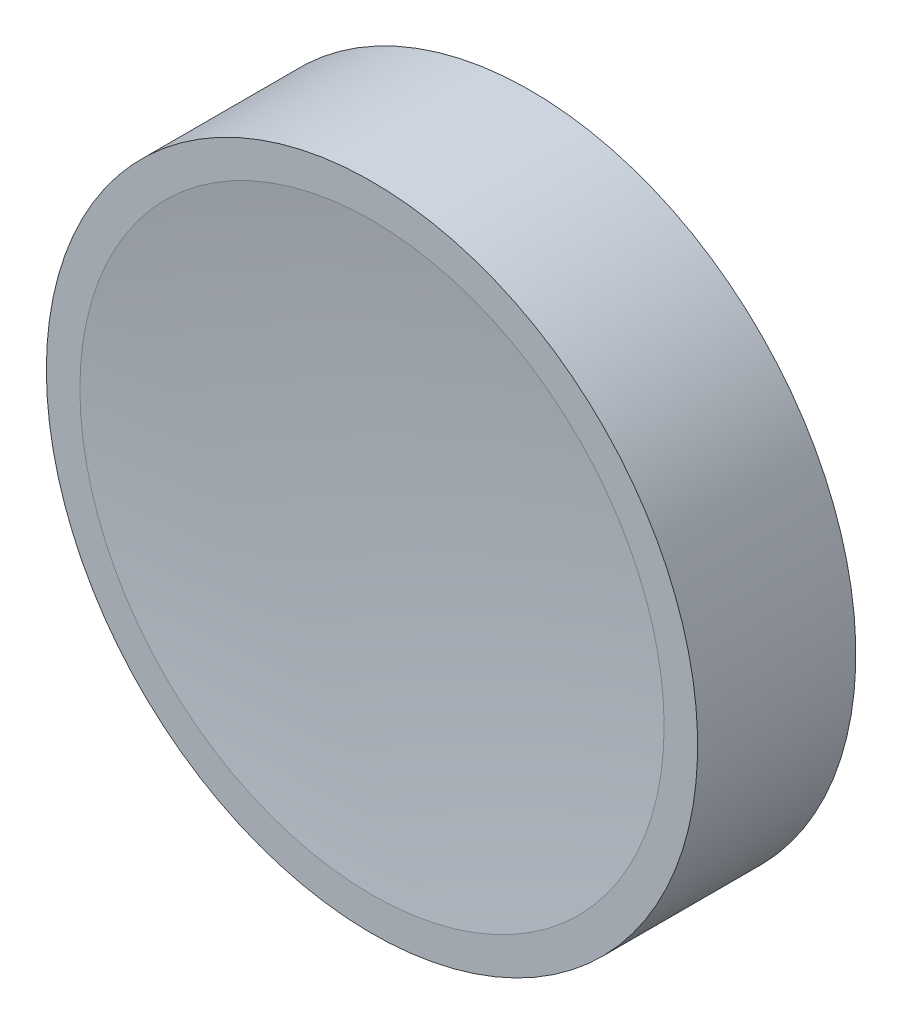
ISO-10303-21;
HEADER;
FILE_DESCRIPTION(('STEP AP214'),'2;1');
FILE_NAME('part.step','',(''),(''),'','','');
FILE_SCHEMA(('AUTOMOTIVE_DESIGN { 1 0 10303 214 1 1 1 1 }'));
ENDSEC;
DATA;
#1=APPLICATION_CONTEXT('core data for automotive mechanical design processes');
#2=APPLICATION_PROTOCOL_DEFINITION('international standard','automotive_design',2000,#1);
#3=PRODUCT_CONTEXT('',#1,'mechanical');
#4=PRODUCT('Part','Part','',(#3));
#5=PRODUCT_RELATED_PRODUCT_CATEGORY('part','',(#4));
#6=PRODUCT_DEFINITION_FORMATION('','',#4);
#7=PRODUCT_DEFINITION_CONTEXT('part definition',#1,'design');
#8=PRODUCT_DEFINITION('design','',#6,#7);
#9=PRODUCT_DEFINITION_SHAPE('','',#8);
#10=(LENGTH_UNIT() NAMED_UNIT(*) SI_UNIT(.MILLI.,.METRE.));
#11=(NAMED_UNIT(*) PLANE_ANGLE_UNIT() SI_UNIT($,.RADIAN.));
#12=(NAMED_UNIT(*) SI_UNIT($,.STERADIAN.) SOLID_ANGLE_UNIT());
#13=UNCERTAINTY_MEASURE_WITH_UNIT(LENGTH_MEASURE(1.E-05),#10,'distance_accuracy_value','');
#14=(GEOMETRIC_REPRESENTATION_CONTEXT(3) GLOBAL_UNCERTAINTY_ASSIGNED_CONTEXT((#13)) GLOBAL_UNIT_ASSIGNED_CONTEXT((#10,
#11,#12)) REPRESENTATION_CONTEXT('',''));
#15=CARTESIAN_POINT('',(0.,0.,0.));
#16=DIRECTION('',(0.,0.,1.));
#17=DIRECTION('',(1.,0.,0.));
#18=AXIS2_PLACEMENT_3D('',#15,#16,#17);
#19=CARTESIAN_POINT('',(0.,0.,9.6572));
#20=DIRECTION('',(0.,0.,-1.));
#21=DIRECTION('',(-1.,0.,0.));
#22=AXIS2_PLACEMENT_3D('',#19,#20,#21);
#23=CYLINDRICAL_SURFACE('',#22,17.);
#24=CARTESIAN_POINT('',(0.,0.,9.4295346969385));
#25=DIRECTION('',(0.,0.,-1.));
#26=DIRECTION('',(-1.,0.,0.));
#27=AXIS2_PLACEMENT_3D('',#24,#25,#26);
#28=CIRCLE('',#27,16.9999999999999);
#29=CARTESIAN_POINT('',(-16.9999999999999,0.,9.4295346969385));
#30=VERTEX_POINT('',#29);
#31=EDGE_CURVE('E43',#30,#30,#28,.T.);
#32=ORIENTED_EDGE('',*,*,#31,.T.);
#33=EDGE_LOOP('',(#32));
#34=FACE_BOUND('',#33,.T.);
#35=CARTESIAN_POINT('',(0.,0.,1.17120102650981));
#36=DIRECTION('',(0.,0.,-1.));
#37=DIRECTION('',(-1.,0.,0.));
#38=AXIS2_PLACEMENT_3D('',#35,#36,#37);
#39=CIRCLE('',#38,17.);
#40=CARTESIAN_POINT('',(-17.,0.,1.17120102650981));
#41=VERTEX_POINT('',#40);
#42=EDGE_CURVE('E10',#41,#41,#39,.T.);
#43=ORIENTED_EDGE('',*,*,#42,.F.);
#44=EDGE_LOOP('',(#43));
#45=FACE_BOUND('',#44,.T.);
#46=ADVANCED_FACE('F33',(#34,#45),#23,.T.);
#47=CARTESIAN_POINT('',(-17.,0.,1.17120102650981));
#48=DIRECTION('',(0.,0.,1.));
#49=DIRECTION('',(1.,0.,0.));
#50=AXIS2_PLACEMENT_3D('',#47,#48,#49);
#51=PLANE('',#50);
#52=CARTESIAN_POINT('',(0.,0.,1.17120102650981));
#53=DIRECTION('',(0.,0.,-1.));
#54=DIRECTION('',(-1.,0.,0.));
#55=AXIS2_PLACEMENT_3D('',#52,#53,#54);
#56=CIRCLE('',#55,15.25);
#57=CARTESIAN_POINT('',(-15.25,0.,1.17120102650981));
#58=VERTEX_POINT('',#57);
#59=EDGE_CURVE('E39',#58,#58,#56,.T.);
#60=ORIENTED_EDGE('',*,*,#59,.F.);
#61=EDGE_LOOP('',(#60));
#62=FACE_BOUND('',#61,.T.);
#63=ORIENTED_EDGE('',*,*,#42,.T.);
#64=EDGE_LOOP('',(#63));
#65=FACE_BOUND('',#64,.T.);
#66=ADVANCED_FACE('F66',(#62,#65),#51,.F.);
#67=CARTESIAN_POINT('',(0.,0.,-23.5082564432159));
#68=DIRECTION('',(0.,0.,-1.));
#69=DIRECTION('',(1.,0.,0.));
#70=AXIS2_PLACEMENT_3D('',#67,#68,#69);
#71=SPHERICAL_SURFACE('',#70,29.011);
#72=ORIENTED_EDGE('',*,*,#59,.T.);
#73=EDGE_LOOP('',(#72));
#74=FACE_BOUND('',#73,.T.);
#75=ADVANCED_FACE('F61',(#74),#71,.F.);
#76=CARTESIAN_POINT('',(-16.9999999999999,0.,9.4295346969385));
#77=DIRECTION('',(0.,0.,-1.));
#78=DIRECTION('',(-1.,0.,0.));
#79=AXIS2_PLACEMENT_3D('',#76,#77,#78);
#80=PLANE('',#79);
#81=ORIENTED_EDGE('',*,*,#31,.F.);
#82=EDGE_LOOP('',(#81));
#83=FACE_BOUND('',#82,.T.);
#84=CARTESIAN_POINT('',(0.,0.,9.4295346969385));
#85=DIRECTION('',(0.,0.,-1.));
#86=DIRECTION('',(-1.,0.,0.));
#87=AXIS2_PLACEMENT_3D('',#84,#85,#86);
#88=CIRCLE('',#87,15.25);
#89=CARTESIAN_POINT('',(-15.25,0.,9.4295346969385));
#90=VERTEX_POINT('',#89);
#91=EDGE_CURVE('E47',#90,#90,#88,.T.);
#92=ORIENTED_EDGE('',*,*,#91,.T.);
#93=EDGE_LOOP('',(#92));
#94=FACE_BOUND('',#93,.T.);
#95=ADVANCED_FACE('F53',(#83,#94),#80,.F.);
#96=CARTESIAN_POINT('',(-1.46421122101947E-06,0.,133.491788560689));
#97=DIRECTION('',(0.,0.,1.));
#98=DIRECTION('',(1.,0.,0.));
#99=AXIS2_PLACEMENT_3D('',#96,#97,#98);
#100=SPHERICAL_SURFACE('',#99,124.996021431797);
#101=ORIENTED_EDGE('',*,*,#91,.F.);
#102=EDGE_LOOP('',(#101));
#103=FACE_BOUND('',#102,.T.);
#104=ADVANCED_FACE('F55',(#103),#100,.F.);
#105=CLOSED_SHELL('',(#46,#66,#75,#95,#104));
#106=MANIFOLD_SOLID_BREP('B2',#105);
#107=ADVANCED_BREP_SHAPE_REPRESENTATION('',(#18,#106),#14);
#108=SHAPE_DEFINITION_REPRESENTATION(#9,#107);
ENDSEC;
END-ISO-10303-21;
